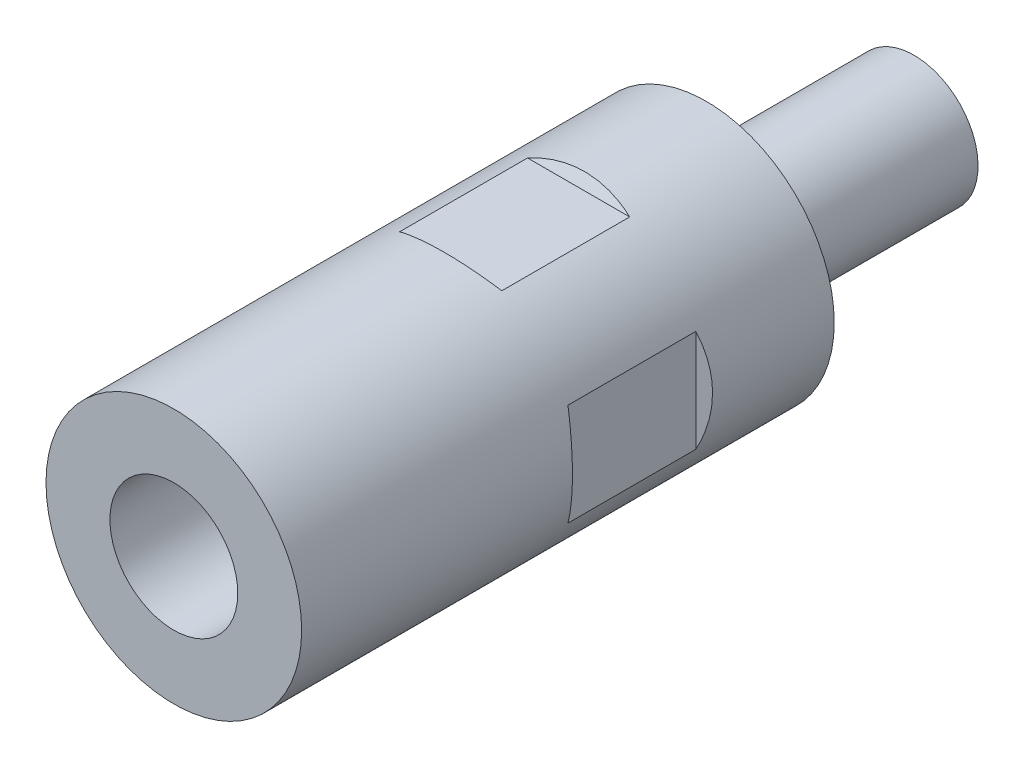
ISO-10303-21;
HEADER;
FILE_DESCRIPTION(('STEP AP214'),'2;1');
FILE_NAME('part.step','',(''),(''),'','','');
FILE_SCHEMA(('AUTOMOTIVE_DESIGN { 1 0 10303 214 1 1 1 1 }'));
ENDSEC;
DATA;
#1=APPLICATION_CONTEXT('core data for automotive mechanical design processes');
#2=APPLICATION_PROTOCOL_DEFINITION('international standard','automotive_design',2000,#1);
#3=PRODUCT_CONTEXT('',#1,'mechanical');
#4=PRODUCT('Part','Part','',(#3));
#5=PRODUCT_RELATED_PRODUCT_CATEGORY('part','',(#4));
#6=PRODUCT_DEFINITION_FORMATION('','',#4);
#7=PRODUCT_DEFINITION_CONTEXT('part definition',#1,'design');
#8=PRODUCT_DEFINITION('design','',#6,#7);
#9=PRODUCT_DEFINITION_SHAPE('','',#8);
#10=(LENGTH_UNIT() NAMED_UNIT(*) SI_UNIT(.MILLI.,.METRE.));
#11=(NAMED_UNIT(*) PLANE_ANGLE_UNIT() SI_UNIT($,.RADIAN.));
#12=(NAMED_UNIT(*) SI_UNIT($,.STERADIAN.) SOLID_ANGLE_UNIT());
#13=UNCERTAINTY_MEASURE_WITH_UNIT(LENGTH_MEASURE(1.E-05),#10,'distance_accuracy_value','');
#14=(GEOMETRIC_REPRESENTATION_CONTEXT(3) GLOBAL_UNCERTAINTY_ASSIGNED_CONTEXT((#13)) GLOBAL_UNIT_ASSIGNED_CONTEXT((#10,
#11,#12)) REPRESENTATION_CONTEXT('',''));
#15=CARTESIAN_POINT('',(0.,0.,0.));
#16=DIRECTION('',(0.,0.,1.));
#17=DIRECTION('',(1.,0.,0.));
#18=AXIS2_PLACEMENT_3D('',#15,#16,#17);
#19=CARTESIAN_POINT('',(0.,0.,-19.5));
#20=DIRECTION('',(0.,0.,1.));
#21=DIRECTION('',(0.,-1.,0.));
#22=AXIS2_PLACEMENT_3D('',#19,#20,#21);
#23=PLANE('',#22);
#24=CARTESIAN_POINT('',(0.,0.,-19.5));
#25=DIRECTION('',(0.,0.,1.));
#26=DIRECTION('',(0.,-1.,0.));
#27=AXIS2_PLACEMENT_3D('',#24,#25,#26);
#28=CIRCLE('',#27,6.);
#29=CARTESIAN_POINT('',(0.,-6.,-19.5));
#30=VERTEX_POINT('',#29);
#31=EDGE_CURVE('E17',#30,#30,#28,.F.);
#32=ORIENTED_EDGE('',*,*,#31,.T.);
#33=EDGE_LOOP('',(#32));
#34=FACE_BOUND('',#33,.T.);
#35=ADVANCED_FACE('F14',(#34),#23,.F.);
#36=CARTESIAN_POINT('',(0.,0.,0.5));
#37=DIRECTION('',(0.,0.,1.));
#38=DIRECTION('',(0.,-1.,0.));
#39=AXIS2_PLACEMENT_3D('',#36,#37,#38);
#40=CYLINDRICAL_SURFACE('',#39,6.);
#41=ORIENTED_EDGE('',*,*,#31,.F.);
#42=EDGE_LOOP('',(#41));
#43=FACE_BOUND('',#42,.T.);
#44=CARTESIAN_POINT('',(0.,0.,0.));
#45=DIRECTION('',(0.,0.,1.));
#46=DIRECTION('',(1.,0.,0.));
#47=AXIS2_PLACEMENT_3D('',#44,#45,#46);
#48=CIRCLE('',#47,6.);
#49=CARTESIAN_POINT('',(6.,0.,0.));
#50=VERTEX_POINT('',#49);
#51=EDGE_CURVE('E9',#50,#50,#48,.T.);
#52=ORIENTED_EDGE('',*,*,#51,.F.);
#53=EDGE_LOOP('',(#52));
#54=FACE_BOUND('',#53,.T.);
#55=ADVANCED_FACE('F175',(#43,#54),#40,.T.);
#56=CARTESIAN_POINT('',(11.,-12.,24.));
#57=DIRECTION('',(-0.5,0.,0.866025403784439));
#58=DIRECTION('',(0.866025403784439,0.,0.5));
#59=AXIS2_PLACEMENT_3D('',#56,#57,#58);
#60=PLANE('',#59);
#61=DIRECTION('',(0.,1.,0.));
#62=VECTOR('',#61,1.);
#63=CARTESIAN_POINT('',(11.,-12.,24.));
#64=LINE('',#63,#62);
#65=CARTESIAN_POINT('',(11.,-4.79583152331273,24.));
#66=VERTEX_POINT('',#65);
#67=CARTESIAN_POINT('',(11.,4.79583152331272,24.));
#68=VERTEX_POINT('',#67);
#69=EDGE_CURVE('E139',#66,#68,#64,.T.);
#70=ORIENTED_EDGE('',*,*,#69,.T.);
#71=CARTESIAN_POINT('',(0.,0.,17.6491470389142));
#72=DIRECTION('',(-0.5,0.,0.866025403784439));
#73=DIRECTION('',(-0.866025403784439,0.,-0.5));
#74=AXIS2_PLACEMENT_3D('',#71,#72,#73);
#75=ELLIPSE('',#74,13.856406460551,12.);
#76=EDGE_CURVE('E35',#66,#68,#75,.T.);
#77=ORIENTED_EDGE('',*,*,#76,.F.);
#78=EDGE_LOOP('',(#70,#77));
#79=FACE_BOUND('',#78,.T.);
#80=ADVANCED_FACE('F194',(#79),#60,.F.);
#81=CARTESIAN_POINT('',(11.,-12.,24.));
#82=DIRECTION('',(-1.,0.,0.));
#83=DIRECTION('',(0.,0.,1.));
#84=AXIS2_PLACEMENT_3D('',#81,#82,#83);
#85=PLANE('',#84);
#86=ORIENTED_EDGE('',*,*,#69,.F.);
#87=DIRECTION('',(0.,0.,-1.));
#88=VECTOR('',#87,1.);
#89=CARTESIAN_POINT('',(11.,-4.79583152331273,50.));
#90=LINE('',#89,#88);
#91=CARTESIAN_POINT('',(11.,-4.79583152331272,12.));
#92=VERTEX_POINT('',#91);
#93=EDGE_CURVE('E126',#92,#66,#90,.F.);
#94=ORIENTED_EDGE('',*,*,#93,.F.);
#95=DIRECTION('',(0.,1.,0.));
#96=VECTOR('',#95,1.);
#97=CARTESIAN_POINT('',(11.,-12.,12.));
#98=LINE('',#97,#96);
#99=CARTESIAN_POINT('',(11.,4.79583152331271,12.));
#100=VERTEX_POINT('',#99);
#101=EDGE_CURVE('E140',#92,#100,#98,.T.);
#102=ORIENTED_EDGE('',*,*,#101,.T.);
#103=DIRECTION('',(0.,0.,-1.));
#104=VECTOR('',#103,1.);
#105=CARTESIAN_POINT('',(11.,4.79583152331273,50.));
#106=LINE('',#105,#104);
#107=EDGE_CURVE('E29',#68,#100,#106,.T.);
#108=ORIENTED_EDGE('',*,*,#107,.F.);
#109=EDGE_LOOP('',(#86,#94,#102,#108));
#110=FACE_BOUND('',#109,.T.);
#111=ADVANCED_FACE('F201',(#110),#85,.F.);
#112=CARTESIAN_POINT('',(11.,-12.,12.));
#113=DIRECTION('',(-0.5,0.,-0.866025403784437));
#114=DIRECTION('',(-0.866025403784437,0.,0.5));
#115=AXIS2_PLACEMENT_3D('',#112,#113,#114);
#116=PLANE('',#115);
#117=CARTESIAN_POINT('',(0.,0.,18.350852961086));
#118=DIRECTION('',(-0.5,0.,-0.866025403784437));
#119=DIRECTION('',(0.866025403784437,0.,-0.5));
#120=AXIS2_PLACEMENT_3D('',#117,#118,#119);
#121=ELLIPSE('',#120,13.856406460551,12.);
#122=EDGE_CURVE('E131',#100,#92,#121,.T.);
#123=ORIENTED_EDGE('',*,*,#122,.F.);
#124=ORIENTED_EDGE('',*,*,#101,.F.);
#125=EDGE_LOOP('',(#123,#124));
#126=FACE_BOUND('',#125,.T.);
#127=ADVANCED_FACE('F213',(#126),#116,.F.);
#128=CARTESIAN_POINT('',(-11.,-12.,12.));
#129=DIRECTION('',(0.5,0.,-0.866025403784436));
#130=DIRECTION('',(-0.866025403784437,0.,-0.5));
#131=AXIS2_PLACEMENT_3D('',#128,#129,#130);
#132=PLANE('',#131);
#133=CARTESIAN_POINT('',(0.,0.,18.350852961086));
#134=DIRECTION('',(0.5,0.,-0.866025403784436));
#135=DIRECTION('',(-0.866025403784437,0.,-0.5));
#136=AXIS2_PLACEMENT_3D('',#133,#134,#135);
#137=ELLIPSE('',#136,13.8564064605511,12.);
#138=CARTESIAN_POINT('',(-11.,-4.79583152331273,12.));
#139=VERTEX_POINT('',#138);
#140=CARTESIAN_POINT('',(-11.,4.79583152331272,12.));
#141=VERTEX_POINT('',#140);
#142=EDGE_CURVE('E124',#139,#141,#137,.T.);
#143=ORIENTED_EDGE('',*,*,#142,.F.);
#144=DIRECTION('',(0.,1.,0.));
#145=VECTOR('',#144,1.);
#146=CARTESIAN_POINT('',(-11.,-12.,12.));
#147=LINE('',#146,#145);
#148=EDGE_CURVE('E144',#139,#141,#147,.T.);
#149=ORIENTED_EDGE('',*,*,#148,.T.);
#150=EDGE_LOOP('',(#143,#149));
#151=FACE_BOUND('',#150,.T.);
#152=ADVANCED_FACE('F217',(#151),#132,.F.);
#153=CARTESIAN_POINT('',(-11.,-12.,24.));
#154=DIRECTION('',(0.5,0.,0.866025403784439));
#155=DIRECTION('',(0.866025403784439,0.,-0.5));
#156=AXIS2_PLACEMENT_3D('',#153,#154,#155);
#157=PLANE('',#156);
#158=DIRECTION('',(0.,1.,0.));
#159=VECTOR('',#158,1.);
#160=CARTESIAN_POINT('',(-11.,-12.,24.));
#161=LINE('',#160,#159);
#162=CARTESIAN_POINT('',(-11.,-4.79583152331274,24.));
#163=VERTEX_POINT('',#162);
#164=CARTESIAN_POINT('',(-11.,4.79583152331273,24.));
#165=VERTEX_POINT('',#164);
#166=EDGE_CURVE('E142',#163,#165,#161,.T.);
#167=ORIENTED_EDGE('',*,*,#166,.F.);
#168=CARTESIAN_POINT('',(0.,0.,17.6491470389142));
#169=DIRECTION('',(0.5,0.,0.866025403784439));
#170=DIRECTION('',(0.866025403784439,0.,-0.5));
#171=AXIS2_PLACEMENT_3D('',#168,#169,#170);
#172=ELLIPSE('',#171,13.856406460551,12.);
#173=EDGE_CURVE('E115',#165,#163,#172,.T.);
#174=ORIENTED_EDGE('',*,*,#173,.F.);
#175=EDGE_LOOP('',(#167,#174));
#176=FACE_BOUND('',#175,.T.);
#177=ADVANCED_FACE('F224',(#176),#157,.F.);
#178=CARTESIAN_POINT('',(-11.,-12.,24.));
#179=DIRECTION('',(1.,0.,0.));
#180=DIRECTION('',(0.,0.,-1.));
#181=AXIS2_PLACEMENT_3D('',#178,#179,#180);
#182=PLANE('',#181);
#183=ORIENTED_EDGE('',*,*,#166,.T.);
#184=DIRECTION('',(0.,0.,-1.));
#185=VECTOR('',#184,1.);
#186=CARTESIAN_POINT('',(-11.,4.79583152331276,50.));
#187=LINE('',#186,#185);
#188=EDGE_CURVE('E121',#141,#165,#187,.F.);
#189=ORIENTED_EDGE('',*,*,#188,.F.);
#190=ORIENTED_EDGE('',*,*,#148,.F.);
#191=DIRECTION('',(0.,0.,-1.));
#192=VECTOR('',#191,1.);
#193=CARTESIAN_POINT('',(-11.,-4.79583152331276,50.));
#194=LINE('',#193,#192);
#195=EDGE_CURVE('E118',#163,#139,#194,.T.);
#196=ORIENTED_EDGE('',*,*,#195,.F.);
#197=EDGE_LOOP('',(#183,#189,#190,#196));
#198=FACE_BOUND('',#197,.T.);
#199=ADVANCED_FACE('F219',(#198),#182,.F.);
#200=CARTESIAN_POINT('',(12.,11.,24.));
#201=DIRECTION('',(0.,-0.5,0.866025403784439));
#202=DIRECTION('',(0.,-0.866025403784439,-0.5));
#203=AXIS2_PLACEMENT_3D('',#200,#201,#202);
#204=PLANE('',#203);
#205=DIRECTION('',(-1.,0.,0.));
#206=VECTOR('',#205,1.);
#207=CARTESIAN_POINT('',(12.,11.,24.));
#208=LINE('',#207,#206);
#209=CARTESIAN_POINT('',(4.79583152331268,11.,24.));
#210=VERTEX_POINT('',#209);
#211=CARTESIAN_POINT('',(-4.79583152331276,11.,24.));
#212=VERTEX_POINT('',#211);
#213=EDGE_CURVE('E147',#210,#212,#208,.T.);
#214=ORIENTED_EDGE('',*,*,#213,.T.);
#215=CARTESIAN_POINT('',(0.,0.,17.6491470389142));
#216=DIRECTION('',(0.,-0.5,0.866025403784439));
#217=DIRECTION('',(0.,-0.866025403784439,-0.5));
#218=AXIS2_PLACEMENT_3D('',#215,#216,#217);
#219=ELLIPSE('',#218,13.856406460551,12.);
#220=EDGE_CURVE('E107',#210,#212,#219,.T.);
#221=ORIENTED_EDGE('',*,*,#220,.F.);
#222=EDGE_LOOP('',(#214,#221));
#223=FACE_BOUND('',#222,.T.);
#224=ADVANCED_FACE('F223',(#223),#204,.F.);
#225=CARTESIAN_POINT('',(12.,11.,24.));
#226=DIRECTION('',(0.,-1.,0.));
#227=DIRECTION('',(1.,0.,0.));
#228=AXIS2_PLACEMENT_3D('',#225,#226,#227);
#229=PLANE('',#228);
#230=ORIENTED_EDGE('',*,*,#213,.F.);
#231=DIRECTION('',(0.,0.,-1.));
#232=VECTOR('',#231,1.);
#233=CARTESIAN_POINT('',(4.79583152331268,11.,50.));
#234=LINE('',#233,#232);
#235=CARTESIAN_POINT('',(4.79583152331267,11.,12.));
#236=VERTEX_POINT('',#235);
#237=EDGE_CURVE('E88',#236,#210,#234,.F.);
#238=ORIENTED_EDGE('',*,*,#237,.F.);
#239=DIRECTION('',(-1.,0.,0.));
#240=VECTOR('',#239,1.);
#241=CARTESIAN_POINT('',(12.,11.,12.));
#242=LINE('',#241,#240);
#243=CARTESIAN_POINT('',(-4.79583152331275,11.,12.));
#244=VERTEX_POINT('',#243);
#245=EDGE_CURVE('E150',#236,#244,#242,.T.);
#246=ORIENTED_EDGE('',*,*,#245,.T.);
#247=DIRECTION('',(0.,0.,-1.));
#248=VECTOR('',#247,1.);
#249=CARTESIAN_POINT('',(-4.79583152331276,11.,50.));
#250=LINE('',#249,#248);
#251=EDGE_CURVE('E110',#212,#244,#250,.T.);
#252=ORIENTED_EDGE('',*,*,#251,.F.);
#253=EDGE_LOOP('',(#230,#238,#246,#252));
#254=FACE_BOUND('',#253,.T.);
#255=ADVANCED_FACE('F234',(#254),#229,.F.);
#256=CARTESIAN_POINT('',(12.,11.,12.));
#257=DIRECTION('',(0.,-0.5,-0.866025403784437));
#258=DIRECTION('',(0.,0.866025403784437,-0.5));
#259=AXIS2_PLACEMENT_3D('',#256,#257,#258);
#260=PLANE('',#259);
#261=CARTESIAN_POINT('',(0.,0.,18.350852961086));
#262=DIRECTION('',(0.,-0.5,-0.866025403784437));
#263=DIRECTION('',(0.,0.866025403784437,-0.5));
#264=AXIS2_PLACEMENT_3D('',#261,#262,#263);
#265=ELLIPSE('',#264,13.856406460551,12.);
#266=EDGE_CURVE('E113',#244,#236,#265,.T.);
#267=ORIENTED_EDGE('',*,*,#266,.F.);
#268=ORIENTED_EDGE('',*,*,#245,.F.);
#269=EDGE_LOOP('',(#267,#268));
#270=FACE_BOUND('',#269,.T.);
#271=ADVANCED_FACE('F184',(#270),#260,.F.);
#272=CARTESIAN_POINT('',(12.,-11.,12.));
#273=DIRECTION('',(0.,0.5,-0.866025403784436));
#274=DIRECTION('',(0.,0.866025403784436,0.5));
#275=AXIS2_PLACEMENT_3D('',#272,#273,#274);
#276=PLANE('',#275);
#277=CARTESIAN_POINT('',(0.,0.,18.350852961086));
#278=DIRECTION('',(0.,0.5,-0.866025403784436));
#279=DIRECTION('',(0.,-0.866025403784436,-0.5));
#280=AXIS2_PLACEMENT_3D('',#277,#278,#279);
#281=ELLIPSE('',#280,13.8564064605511,12.);
#282=CARTESIAN_POINT('',(4.79583152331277,-11.,12.));
#283=VERTEX_POINT('',#282);
#284=CARTESIAN_POINT('',(-4.79583152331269,-11.,12.));
#285=VERTEX_POINT('',#284);
#286=EDGE_CURVE('E79',#283,#285,#281,.T.);
#287=ORIENTED_EDGE('',*,*,#286,.F.);
#288=DIRECTION('',(-1.,0.,0.));
#289=VECTOR('',#288,1.);
#290=CARTESIAN_POINT('',(12.,-11.,12.));
#291=LINE('',#290,#289);
#292=EDGE_CURVE('E82',#283,#285,#291,.T.);
#293=ORIENTED_EDGE('',*,*,#292,.T.);
#294=EDGE_LOOP('',(#287,#293));
#295=FACE_BOUND('',#294,.T.);
#296=ADVANCED_FACE('F81',(#295),#276,.F.);
#297=CARTESIAN_POINT('',(12.,-11.,24.));
#298=DIRECTION('',(0.,0.5,0.866025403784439));
#299=DIRECTION('',(0.,-0.866025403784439,0.5));
#300=AXIS2_PLACEMENT_3D('',#297,#298,#299);
#301=PLANE('',#300);
#302=DIRECTION('',(-1.,0.,0.));
#303=VECTOR('',#302,1.);
#304=CARTESIAN_POINT('',(12.,-11.,24.));
#305=LINE('',#304,#303);
#306=CARTESIAN_POINT('',(4.79583152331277,-11.,24.));
#307=VERTEX_POINT('',#306);
#308=CARTESIAN_POINT('',(-4.79583152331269,-11.,24.));
#309=VERTEX_POINT('',#308);
#310=EDGE_CURVE('E95',#307,#309,#305,.T.);
#311=ORIENTED_EDGE('',*,*,#310,.F.);
#312=CARTESIAN_POINT('',(0.,0.,17.6491470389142));
#313=DIRECTION('',(0.,0.5,0.866025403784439));
#314=DIRECTION('',(0.,0.866025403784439,-0.5));
#315=AXIS2_PLACEMENT_3D('',#312,#313,#314);
#316=ELLIPSE('',#315,13.856406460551,12.);
#317=EDGE_CURVE('E101',#309,#307,#316,.T.);
#318=ORIENTED_EDGE('',*,*,#317,.F.);
#319=EDGE_LOOP('',(#311,#318));
#320=FACE_BOUND('',#319,.T.);
#321=ADVANCED_FACE('F183',(#320),#301,.F.);
#322=CARTESIAN_POINT('',(12.,-11.,24.));
#323=DIRECTION('',(0.,1.,0.));
#324=DIRECTION('',(-1.,0.,0.));
#325=AXIS2_PLACEMENT_3D('',#322,#323,#324);
#326=PLANE('',#325);
#327=ORIENTED_EDGE('',*,*,#310,.T.);
#328=DIRECTION('',(0.,0.,-1.));
#329=VECTOR('',#328,1.);
#330=CARTESIAN_POINT('',(-4.79583152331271,-11.,50.));
#331=LINE('',#330,#329);
#332=EDGE_CURVE('E87',#285,#309,#331,.F.);
#333=ORIENTED_EDGE('',*,*,#332,.F.);
#334=ORIENTED_EDGE('',*,*,#292,.F.);
#335=DIRECTION('',(0.,0.,-1.));
#336=VECTOR('',#335,1.);
#337=CARTESIAN_POINT('',(4.79583152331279,-11.,50.));
#338=LINE('',#337,#336);
#339=EDGE_CURVE('E93',#307,#283,#338,.T.);
#340=ORIENTED_EDGE('',*,*,#339,.F.);
#341=EDGE_LOOP('',(#327,#333,#334,#340));
#342=FACE_BOUND('',#341,.T.);
#343=ADVANCED_FACE('F92',(#342),#326,.F.);
#344=CARTESIAN_POINT('',(0.,0.,50.));
#345=DIRECTION('',(0.,0.,-1.));
#346=DIRECTION('',(-1.,0.,0.));
#347=AXIS2_PLACEMENT_3D('',#344,#345,#346);
#348=CYLINDRICAL_SURFACE('',#347,12.);
#349=ORIENTED_EDGE('',*,*,#332,.T.);
#350=ORIENTED_EDGE('',*,*,#317,.T.);
#351=ORIENTED_EDGE('',*,*,#339,.T.);
#352=ORIENTED_EDGE('',*,*,#286,.T.);
#353=EDGE_LOOP('',(#349,#350,#351,#352));
#354=FACE_BOUND('',#353,.T.);
#355=ORIENTED_EDGE('',*,*,#266,.T.);
#356=ORIENTED_EDGE('',*,*,#237,.T.);
#357=ORIENTED_EDGE('',*,*,#220,.T.);
#358=ORIENTED_EDGE('',*,*,#251,.T.);
#359=EDGE_LOOP('',(#355,#356,#357,#358));
#360=FACE_BOUND('',#359,.T.);
#361=ORIENTED_EDGE('',*,*,#188,.T.);
#362=ORIENTED_EDGE('',*,*,#173,.T.);
#363=ORIENTED_EDGE('',*,*,#195,.T.);
#364=ORIENTED_EDGE('',*,*,#142,.T.);
#365=EDGE_LOOP('',(#361,#362,#363,#364));
#366=FACE_BOUND('',#365,.T.);
#367=ORIENTED_EDGE('',*,*,#122,.T.);
#368=ORIENTED_EDGE('',*,*,#93,.T.);
#369=ORIENTED_EDGE('',*,*,#76,.T.);
#370=ORIENTED_EDGE('',*,*,#107,.T.);
#371=EDGE_LOOP('',(#367,#368,#369,#370));
#372=FACE_BOUND('',#371,.T.);
#373=CARTESIAN_POINT('',(0.,0.,50.));
#374=DIRECTION('',(0.,0.,1.));
#375=DIRECTION('',(1.,0.,0.));
#376=AXIS2_PLACEMENT_3D('',#373,#374,#375);
#377=CIRCLE('',#376,12.);
#378=CARTESIAN_POINT('',(12.,0.,50.));
#379=VERTEX_POINT('',#378);
#380=EDGE_CURVE('E133',#379,#379,#377,.T.);
#381=ORIENTED_EDGE('',*,*,#380,.F.);
#382=EDGE_LOOP('',(#381));
#383=FACE_BOUND('',#382,.T.);
#384=CARTESIAN_POINT('',(0.,0.,0.));
#385=DIRECTION('',(0.,0.,1.));
#386=DIRECTION('',(1.,0.,0.));
#387=AXIS2_PLACEMENT_3D('',#384,#385,#386);
#388=CIRCLE('',#387,12.);
#389=CARTESIAN_POINT('',(12.,0.,0.));
#390=VERTEX_POINT('',#389);
#391=EDGE_CURVE('E136',#390,#390,#388,.T.);
#392=ORIENTED_EDGE('',*,*,#391,.T.);
#393=EDGE_LOOP('',(#392));
#394=FACE_BOUND('',#393,.T.);
#395=ADVANCED_FACE('F99',(#354,#360,#366,#372,#383,#394),#348,.T.);
#396=CARTESIAN_POINT('',(0.,0.,0.));
#397=DIRECTION('',(0.,0.,1.));
#398=DIRECTION('',(1.,0.,0.));
#399=AXIS2_PLACEMENT_3D('',#396,#397,#398);
#400=PLANE('',#399);
#401=ORIENTED_EDGE('',*,*,#51,.T.);
#402=EDGE_LOOP('',(#401));
#403=FACE_BOUND('',#402,.T.);
#404=ORIENTED_EDGE('',*,*,#391,.F.);
#405=EDGE_LOOP('',(#404));
#406=FACE_BOUND('',#405,.T.);
#407=ADVANCED_FACE('F176',(#403,#406),#400,.F.);
#408=CARTESIAN_POINT('',(0.,0.,50.));
#409=DIRECTION('',(0.,0.,1.));
#410=DIRECTION('',(1.,0.,0.));
#411=AXIS2_PLACEMENT_3D('',#408,#409,#410);
#412=PLANE('',#411);
#413=CARTESIAN_POINT('',(0.,0.,50.));
#414=DIRECTION('',(0.,0.,1.));
#415=DIRECTION('',(1.,0.,0.));
#416=AXIS2_PLACEMENT_3D('',#413,#414,#415);
#417=CIRCLE('',#416,6.);
#418=CARTESIAN_POINT('',(6.,0.,50.));
#419=VERTEX_POINT('',#418);
#420=EDGE_CURVE('E96',#419,#419,#417,.T.);
#421=ORIENTED_EDGE('',*,*,#420,.F.);
#422=EDGE_LOOP('',(#421));
#423=FACE_BOUND('',#422,.T.);
#424=ORIENTED_EDGE('',*,*,#380,.T.);
#425=EDGE_LOOP('',(#424));
#426=FACE_BOUND('',#425,.T.);
#427=ADVANCED_FACE('F166',(#423,#426),#412,.T.);
#428=CARTESIAN_POINT('',(0.,0.,50.));
#429=DIRECTION('',(0.,0.,1.));
#430=DIRECTION('',(1.,0.,0.));
#431=AXIS2_PLACEMENT_3D('',#428,#429,#430);
#432=CYLINDRICAL_SURFACE('',#431,6.);
#433=ORIENTED_EDGE('',*,*,#420,.T.);
#434=EDGE_LOOP('',(#433));
#435=FACE_BOUND('',#434,.T.);
#436=CARTESIAN_POINT('',(0.,0.,15.5));
#437=DIRECTION('',(0.,0.,1.));
#438=DIRECTION('',(1.,0.,0.));
#439=AXIS2_PLACEMENT_3D('',#436,#437,#438);
#440=CIRCLE('',#439,6.);
#441=CARTESIAN_POINT('',(6.,0.,15.5));
#442=VERTEX_POINT('',#441);
#443=EDGE_CURVE('E157',#442,#442,#440,.T.);
#444=ORIENTED_EDGE('',*,*,#443,.F.);
#445=EDGE_LOOP('',(#444));
#446=FACE_BOUND('',#445,.T.);
#447=ADVANCED_FACE('F164',(#435,#446),#432,.F.);
#448=CARTESIAN_POINT('',(0.,0.,15.5));
#449=DIRECTION('',(0.,0.,1.));
#450=DIRECTION('',(1.,0.,0.));
#451=AXIS2_PLACEMENT_3D('',#448,#449,#450);
#452=PLANE('',#451);
#453=ORIENTED_EDGE('',*,*,#443,.T.);
#454=EDGE_LOOP('',(#453));
#455=FACE_BOUND('',#454,.T.);
#456=ADVANCED_FACE('F162',(#455),#452,.T.);
#457=CLOSED_SHELL('',(#35,#55,#80,#111,#127,#152,#177,#199,#224,#255,#271,#296,#321,#343,#395,
#407,#427,#447,#456));
#458=MANIFOLD_SOLID_BREP('B1',#457);
#459=ADVANCED_BREP_SHAPE_REPRESENTATION('',(#18,#458),#14);
#460=SHAPE_DEFINITION_REPRESENTATION(#9,#459);
ENDSEC;
END-ISO-10303-21;
